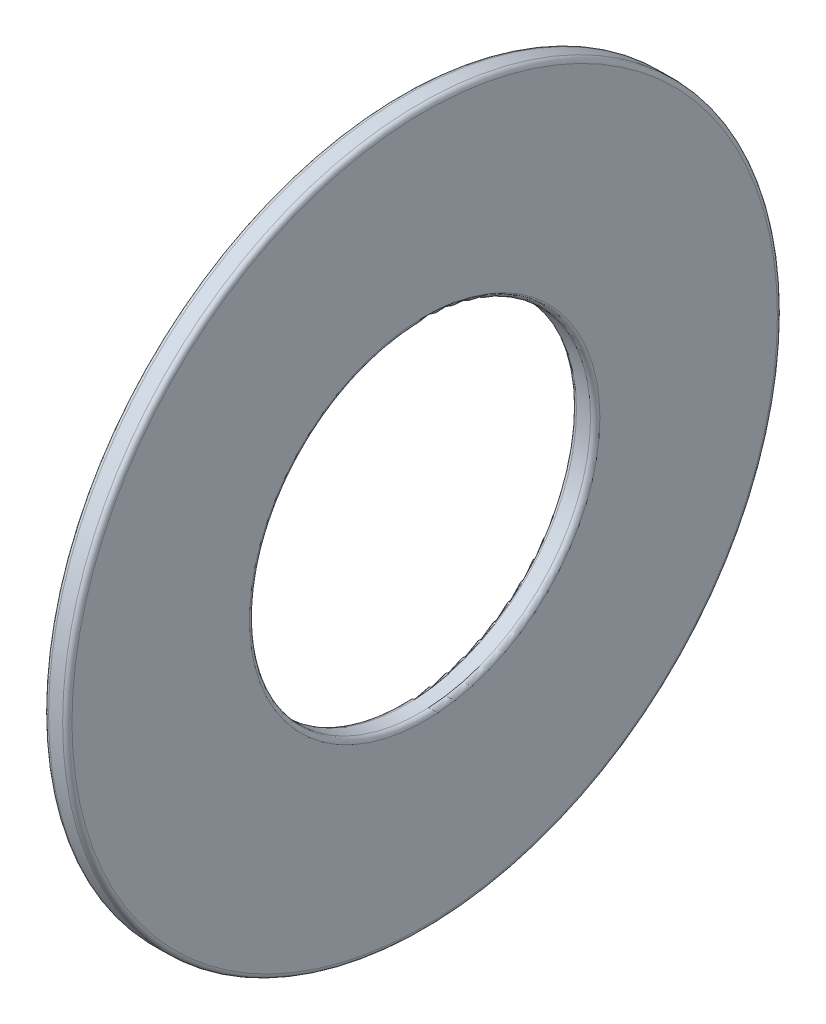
ISO-10303-21;
HEADER;
FILE_DESCRIPTION(('STEP AP214'),'2;1');
FILE_NAME('part.step','',(''),(''),'','','');
FILE_SCHEMA(('AUTOMOTIVE_DESIGN { 1 0 10303 214 1 1 1 1 }'));
ENDSEC;
DATA;
#1=APPLICATION_CONTEXT('core data for automotive mechanical design processes');
#2=APPLICATION_PROTOCOL_DEFINITION('international standard','automotive_design',2000,#1);
#3=PRODUCT_CONTEXT('',#1,'mechanical');
#4=PRODUCT('Part','Part','',(#3));
#5=PRODUCT_RELATED_PRODUCT_CATEGORY('part','',(#4));
#6=PRODUCT_DEFINITION_FORMATION('','',#4);
#7=PRODUCT_DEFINITION_CONTEXT('part definition',#1,'design');
#8=PRODUCT_DEFINITION('design','',#6,#7);
#9=PRODUCT_DEFINITION_SHAPE('','',#8);
#10=(LENGTH_UNIT() NAMED_UNIT(*) SI_UNIT(.MILLI.,.METRE.));
#11=(NAMED_UNIT(*) PLANE_ANGLE_UNIT() SI_UNIT($,.RADIAN.));
#12=(NAMED_UNIT(*) SI_UNIT($,.STERADIAN.) SOLID_ANGLE_UNIT());
#13=UNCERTAINTY_MEASURE_WITH_UNIT(LENGTH_MEASURE(1.E-05),#10,'distance_accuracy_value','');
#14=(GEOMETRIC_REPRESENTATION_CONTEXT(3) GLOBAL_UNCERTAINTY_ASSIGNED_CONTEXT((#13)) GLOBAL_UNIT_ASSIGNED_CONTEXT((#10,
#11,#12)) REPRESENTATION_CONTEXT('',''));
#15=CARTESIAN_POINT('',(0.,0.,0.));
#16=DIRECTION('',(0.,0.,1.));
#17=DIRECTION('',(1.,0.,0.));
#18=AXIS2_PLACEMENT_3D('',#15,#16,#17);
#19=CARTESIAN_POINT('',(1.143,0.,0.));
#20=DIRECTION('',(1.,0.,0.));
#21=DIRECTION('',(0.,0.,-1.));
#22=AXIS2_PLACEMENT_3D('',#19,#20,#21);
#23=PLANE('',#22);
#24=CARTESIAN_POINT('',(1.143,0.,0.));
#25=DIRECTION('',(1.,0.,0.));
#26=DIRECTION('',(0.,0.,-1.));
#27=AXIS2_PLACEMENT_3D('',#24,#25,#26);
#28=CIRCLE('',#27,34.4678);
#29=CARTESIAN_POINT('',(1.143,0.,-34.4678));
#30=VERTEX_POINT('',#29);
#31=EDGE_CURVE('E71',#30,#30,#28,.T.);
#32=ORIENTED_EDGE('',*,*,#31,.T.);
#33=EDGE_LOOP('',(#32));
#34=FACE_BOUND('',#33,.T.);
#35=CARTESIAN_POINT('',(1.143,0.,0.));
#36=DIRECTION('',(1.,0.,0.));
#37=DIRECTION('',(0.,0.,-1.));
#38=AXIS2_PLACEMENT_3D('',#35,#36,#37);
#39=CIRCLE('',#38,17.1196);
#40=CARTESIAN_POINT('',(1.143,0.,-17.1196));
#41=VERTEX_POINT('',#40);
#42=EDGE_CURVE('E79',#41,#41,#39,.F.);
#43=ORIENTED_EDGE('',*,*,#42,.T.);
#44=EDGE_LOOP('',(#43));
#45=FACE_BOUND('',#44,.T.);
#46=ADVANCED_FACE('F43',(#34,#45),#23,.T.);
#47=CARTESIAN_POINT('',(-1.143,0.,0.));
#48=DIRECTION('',(1.,0.,0.));
#49=DIRECTION('',(0.,0.,-1.));
#50=AXIS2_PLACEMENT_3D('',#47,#48,#49);
#51=PLANE('',#50);
#52=CARTESIAN_POINT('',(-1.143,0.,0.));
#53=DIRECTION('',(1.,0.,0.));
#54=DIRECTION('',(0.,0.,-1.));
#55=AXIS2_PLACEMENT_3D('',#52,#53,#54);
#56=CIRCLE('',#55,34.4678);
#57=CARTESIAN_POINT('',(-1.143,0.,-34.4678));
#58=VERTEX_POINT('',#57);
#59=EDGE_CURVE('E57',#58,#58,#56,.F.);
#60=ORIENTED_EDGE('',*,*,#59,.T.);
#61=EDGE_LOOP('',(#60));
#62=FACE_BOUND('',#61,.T.);
#63=CARTESIAN_POINT('',(-1.143,0.,0.));
#64=DIRECTION('',(1.,0.,0.));
#65=DIRECTION('',(0.,0.,-1.));
#66=AXIS2_PLACEMENT_3D('',#63,#64,#65);
#67=CIRCLE('',#66,17.1196);
#68=CARTESIAN_POINT('',(-1.143,0.,-17.1196));
#69=VERTEX_POINT('',#68);
#70=EDGE_CURVE('E62',#69,#69,#67,.T.);
#71=ORIENTED_EDGE('',*,*,#70,.T.);
#72=EDGE_LOOP('',(#71));
#73=FACE_BOUND('',#72,.T.);
#74=ADVANCED_FACE('F96',(#62,#73),#51,.F.);
#75=CARTESIAN_POINT('',(1.143,0.,0.));
#76=DIRECTION('',(-1.,0.,0.));
#77=DIRECTION('',(0.,0.,1.));
#78=AXIS2_PLACEMENT_3D('',#75,#76,#77);
#79=CYLINDRICAL_SURFACE('',#78,34.925);
#80=CARTESIAN_POINT('',(0.6858,0.,0.));
#81=DIRECTION('',(1.,0.,0.));
#82=DIRECTION('',(0.,0.,-1.));
#83=AXIS2_PLACEMENT_3D('',#80,#81,#82);
#84=CIRCLE('',#83,34.925);
#85=CARTESIAN_POINT('',(0.6858,0.,-34.925));
#86=VERTEX_POINT('',#85);
#87=EDGE_CURVE('E70',#86,#86,#84,.F.);
#88=ORIENTED_EDGE('',*,*,#87,.T.);
#89=EDGE_LOOP('',(#88));
#90=FACE_BOUND('',#89,.T.);
#91=CARTESIAN_POINT('',(-0.6858,0.,0.));
#92=DIRECTION('',(1.,0.,0.));
#93=DIRECTION('',(0.,0.,-1.));
#94=AXIS2_PLACEMENT_3D('',#91,#92,#93);
#95=CIRCLE('',#94,34.925);
#96=CARTESIAN_POINT('',(-0.6858,0.,-34.925));
#97=VERTEX_POINT('',#96);
#98=EDGE_CURVE('E73',#97,#97,#95,.T.);
#99=ORIENTED_EDGE('',*,*,#98,.T.);
#100=EDGE_LOOP('',(#99));
#101=FACE_BOUND('',#100,.T.);
#102=ADVANCED_FACE('F104',(#90,#101),#79,.T.);
#103=CARTESIAN_POINT('',(1.143,0.,0.));
#104=DIRECTION('',(-1.,0.,0.));
#105=DIRECTION('',(0.,0.,1.));
#106=AXIS2_PLACEMENT_3D('',#103,#104,#105);
#107=CYLINDRICAL_SURFACE('',#106,16.6624);
#108=CARTESIAN_POINT('',(0.6858,0.,0.));
#109=DIRECTION('',(1.,0.,0.));
#110=DIRECTION('',(0.,0.,-1.));
#111=AXIS2_PLACEMENT_3D('',#108,#109,#110);
#112=CIRCLE('',#111,16.6624);
#113=CARTESIAN_POINT('',(0.6858,0.,-16.6624));
#114=VERTEX_POINT('',#113);
#115=EDGE_CURVE('E10',#114,#114,#112,.T.);
#116=ORIENTED_EDGE('',*,*,#115,.T.);
#117=EDGE_LOOP('',(#116));
#118=FACE_BOUND('',#117,.T.);
#119=CARTESIAN_POINT('',(-0.6858,0.,0.));
#120=DIRECTION('',(1.,0.,0.));
#121=DIRECTION('',(0.,0.,-1.));
#122=AXIS2_PLACEMENT_3D('',#119,#120,#121);
#123=CIRCLE('',#122,16.6624);
#124=CARTESIAN_POINT('',(-0.6858,0.,-16.6624));
#125=VERTEX_POINT('',#124);
#126=EDGE_CURVE('E51',#125,#125,#123,.F.);
#127=ORIENTED_EDGE('',*,*,#126,.T.);
#128=EDGE_LOOP('',(#127));
#129=FACE_BOUND('',#128,.T.);
#130=ADVANCED_FACE('F108',(#118,#129),#107,.F.);
#131=CARTESIAN_POINT('',(0.6858,0.,0.));
#132=DIRECTION('',(1.,0.,0.));
#133=DIRECTION('',(0.,0.,-1.));
#134=AXIS2_PLACEMENT_3D('',#131,#132,#133);
#135=TOROIDAL_SURFACE('',#134,34.4678,0.4572);
#136=ORIENTED_EDGE('',*,*,#87,.F.);
#137=EDGE_LOOP('',(#136));
#138=FACE_BOUND('',#137,.T.);
#139=ORIENTED_EDGE('',*,*,#31,.F.);
#140=EDGE_LOOP('',(#139));
#141=FACE_BOUND('',#140,.T.);
#142=ADVANCED_FACE('F95',(#138,#141),#135,.T.);
#143=CARTESIAN_POINT('',(-0.6858,0.,0.));
#144=DIRECTION('',(1.,0.,0.));
#145=DIRECTION('',(0.,0.,-1.));
#146=AXIS2_PLACEMENT_3D('',#143,#144,#145);
#147=TOROIDAL_SURFACE('',#146,34.4678,0.4572);
#148=ORIENTED_EDGE('',*,*,#59,.F.);
#149=EDGE_LOOP('',(#148));
#150=FACE_BOUND('',#149,.T.);
#151=ORIENTED_EDGE('',*,*,#98,.F.);
#152=EDGE_LOOP('',(#151));
#153=FACE_BOUND('',#152,.T.);
#154=ADVANCED_FACE('F87',(#150,#153),#147,.T.);
#155=CARTESIAN_POINT('',(0.6858,0.,0.));
#156=DIRECTION('',(1.,0.,0.));
#157=DIRECTION('',(0.,0.,-1.));
#158=AXIS2_PLACEMENT_3D('',#155,#156,#157);
#159=TOROIDAL_SURFACE('',#158,17.1196,0.4572);
#160=ORIENTED_EDGE('',*,*,#42,.F.);
#161=EDGE_LOOP('',(#160));
#162=FACE_BOUND('',#161,.T.);
#163=ORIENTED_EDGE('',*,*,#115,.F.);
#164=EDGE_LOOP('',(#163));
#165=FACE_BOUND('',#164,.T.);
#166=ADVANCED_FACE('F83',(#162,#165),#159,.T.);
#167=CARTESIAN_POINT('',(-0.6858,0.,0.));
#168=DIRECTION('',(1.,0.,0.));
#169=DIRECTION('',(0.,0.,-1.));
#170=AXIS2_PLACEMENT_3D('',#167,#168,#169);
#171=TOROIDAL_SURFACE('',#170,17.1196,0.4572);
#172=ORIENTED_EDGE('',*,*,#126,.F.);
#173=EDGE_LOOP('',(#172));
#174=FACE_BOUND('',#173,.T.);
#175=ORIENTED_EDGE('',*,*,#70,.F.);
#176=EDGE_LOOP('',(#175));
#177=FACE_BOUND('',#176,.T.);
#178=ADVANCED_FACE('F44',(#174,#177),#171,.T.);
#179=CLOSED_SHELL('',(#46,#74,#102,#130,#142,#154,#166,#178));
#180=MANIFOLD_SOLID_BREP('B2',#179);
#181=ADVANCED_BREP_SHAPE_REPRESENTATION('',(#18,#180),#14);
#182=SHAPE_DEFINITION_REPRESENTATION(#9,#181);
ENDSEC;
END-ISO-10303-21;
